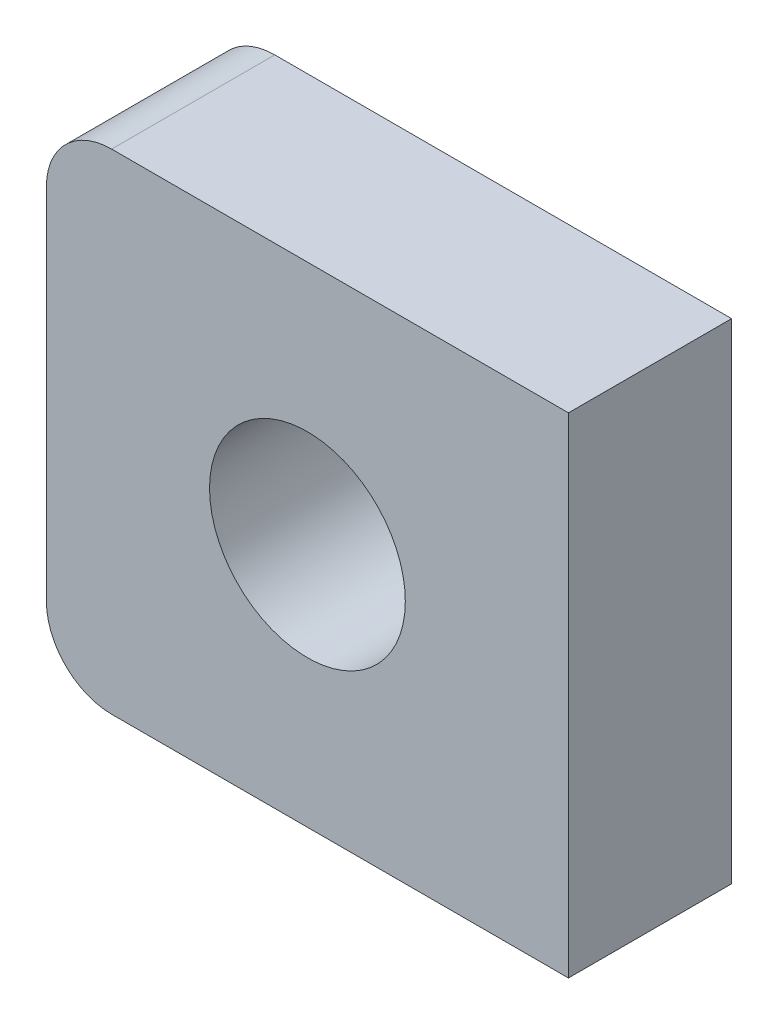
ISO-10303-21;
HEADER;
FILE_DESCRIPTION(('STEP AP214'),'2;1');
FILE_NAME('part.step','',(''),(''),'','','');
FILE_SCHEMA(('AUTOMOTIVE_DESIGN { 1 0 10303 214 1 1 1 1 }'));
ENDSEC;
DATA;
#1=APPLICATION_CONTEXT('core data for automotive mechanical design processes');
#2=APPLICATION_PROTOCOL_DEFINITION('international standard','automotive_design',2000,#1);
#3=PRODUCT_CONTEXT('',#1,'mechanical');
#4=PRODUCT('Part','Part','',(#3));
#5=PRODUCT_RELATED_PRODUCT_CATEGORY('part','',(#4));
#6=PRODUCT_DEFINITION_FORMATION('','',#4);
#7=PRODUCT_DEFINITION_CONTEXT('part definition',#1,'design');
#8=PRODUCT_DEFINITION('design','',#6,#7);
#9=PRODUCT_DEFINITION_SHAPE('','',#8);
#10=(LENGTH_UNIT() NAMED_UNIT(*) SI_UNIT(.MILLI.,.METRE.));
#11=(NAMED_UNIT(*) PLANE_ANGLE_UNIT() SI_UNIT($,.RADIAN.));
#12=(NAMED_UNIT(*) SI_UNIT($,.STERADIAN.) SOLID_ANGLE_UNIT());
#13=UNCERTAINTY_MEASURE_WITH_UNIT(LENGTH_MEASURE(1.E-05),#10,'distance_accuracy_value','');
#14=(GEOMETRIC_REPRESENTATION_CONTEXT(3) GLOBAL_UNCERTAINTY_ASSIGNED_CONTEXT((#13)) GLOBAL_UNIT_ASSIGNED_CONTEXT((#10,
#11,#12)) REPRESENTATION_CONTEXT('',''));
#15=CARTESIAN_POINT('',(0.,0.,0.));
#16=DIRECTION('',(0.,0.,1.));
#17=DIRECTION('',(1.,0.,0.));
#18=AXIS2_PLACEMENT_3D('',#15,#16,#17);
#19=CARTESIAN_POINT('',(0.,0.,5.));
#20=DIRECTION('',(0.,0.,1.));
#21=DIRECTION('',(1.,0.,0.));
#22=AXIS2_PLACEMENT_3D('',#19,#20,#21);
#23=PLANE('',#22);
#24=DIRECTION('',(0.,-1.,0.));
#25=VECTOR('',#24,1.);
#26=CARTESIAN_POINT('',(3.,0.,5.));
#27=LINE('',#26,#25);
#28=CARTESIAN_POINT('',(3.,7.50000000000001,5.));
#29=VERTEX_POINT('',#28);
#30=CARTESIAN_POINT('',(3.,-7.49999999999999,5.));
#31=VERTEX_POINT('',#30);
#32=EDGE_CURVE('E49',#29,#31,#27,.T.);
#33=ORIENTED_EDGE('',*,*,#32,.F.);
#34=DIRECTION('',(-1.,0.,0.));
#35=VECTOR('',#34,1.);
#36=CARTESIAN_POINT('',(-13.,7.50000000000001,5.));
#37=LINE('',#36,#35);
#38=CARTESIAN_POINT('',(-11.,7.50000000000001,5.));
#39=VERTEX_POINT('',#38);
#40=EDGE_CURVE('E56',#29,#39,#37,.T.);
#41=ORIENTED_EDGE('',*,*,#40,.T.);
#42=CARTESIAN_POINT('',(-11.,5.50000000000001,5.));
#43=DIRECTION('',(0.,0.,1.));
#44=DIRECTION('',(1.,0.,0.));
#45=AXIS2_PLACEMENT_3D('',#42,#43,#44);
#46=CIRCLE('',#45,2.);
#47=CARTESIAN_POINT('',(-13.,5.50000000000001,5.));
#48=VERTEX_POINT('',#47);
#49=EDGE_CURVE('E126',#39,#48,#46,.T.);
#50=ORIENTED_EDGE('',*,*,#49,.T.);
#51=DIRECTION('',(0.,-1.,0.));
#52=VECTOR('',#51,1.);
#53=CARTESIAN_POINT('',(-13.,7.50000000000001,5.));
#54=LINE('',#53,#52);
#55=CARTESIAN_POINT('',(-13.,-5.49999999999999,5.));
#56=VERTEX_POINT('',#55);
#57=EDGE_CURVE('E109',#48,#56,#54,.T.);
#58=ORIENTED_EDGE('',*,*,#57,.T.);
#59=CARTESIAN_POINT('',(-11.,-5.49999999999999,5.));
#60=DIRECTION('',(0.,0.,1.));
#61=DIRECTION('',(1.,0.,0.));
#62=AXIS2_PLACEMENT_3D('',#59,#60,#61);
#63=CIRCLE('',#62,2.);
#64=CARTESIAN_POINT('',(-11.,-7.49999999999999,5.));
#65=VERTEX_POINT('',#64);
#66=EDGE_CURVE('E42',#56,#65,#63,.T.);
#67=ORIENTED_EDGE('',*,*,#66,.T.);
#68=DIRECTION('',(1.,0.,0.));
#69=VECTOR('',#68,1.);
#70=CARTESIAN_POINT('',(-13.,-7.49999999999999,5.));
#71=LINE('',#70,#69);
#72=EDGE_CURVE('E117',#65,#31,#71,.T.);
#73=ORIENTED_EDGE('',*,*,#72,.T.);
#74=EDGE_LOOP('',(#33,#41,#50,#58,#67,#73));
#75=FACE_BOUND('',#74,.T.);
#76=CARTESIAN_POINT('',(-5.,0.,5.));
#77=DIRECTION('',(0.,0.,1.));
#78=DIRECTION('',(1.,0.,0.));
#79=AXIS2_PLACEMENT_3D('',#76,#77,#78);
#80=CIRCLE('',#79,3.);
#81=CARTESIAN_POINT('',(-2.,0.,5.));
#82=VERTEX_POINT('',#81);
#83=EDGE_CURVE('E144',#82,#82,#80,.T.);
#84=ORIENTED_EDGE('',*,*,#83,.F.);
#85=EDGE_LOOP('',(#84));
#86=FACE_BOUND('',#85,.T.);
#87=ADVANCED_FACE('F34',(#75,#86),#23,.T.);
#88=CARTESIAN_POINT('',(0.,0.,0.));
#89=DIRECTION('',(0.,0.,1.));
#90=DIRECTION('',(1.,0.,0.));
#91=AXIS2_PLACEMENT_3D('',#88,#89,#90);
#92=PLANE('',#91);
#93=DIRECTION('',(-1.,0.,0.));
#94=VECTOR('',#93,1.);
#95=CARTESIAN_POINT('',(-13.,7.50000000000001,0.));
#96=LINE('',#95,#94);
#97=CARTESIAN_POINT('',(3.,7.50000000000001,0.));
#98=VERTEX_POINT('',#97);
#99=CARTESIAN_POINT('',(-11.,7.50000000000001,0.));
#100=VERTEX_POINT('',#99);
#101=EDGE_CURVE('E101',#98,#100,#96,.T.);
#102=ORIENTED_EDGE('',*,*,#101,.F.);
#103=DIRECTION('',(0.,-1.,0.));
#104=VECTOR('',#103,1.);
#105=CARTESIAN_POINT('',(3.,-7.49999999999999,0.));
#106=LINE('',#105,#104);
#107=CARTESIAN_POINT('',(3.,-7.49999999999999,0.));
#108=VERTEX_POINT('',#107);
#109=EDGE_CURVE('E86',#98,#108,#106,.T.);
#110=ORIENTED_EDGE('',*,*,#109,.T.);
#111=DIRECTION('',(1.,0.,0.));
#112=VECTOR('',#111,1.);
#113=CARTESIAN_POINT('',(-13.,-7.49999999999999,0.));
#114=LINE('',#113,#112);
#115=CARTESIAN_POINT('',(-11.,-7.49999999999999,0.));
#116=VERTEX_POINT('',#115);
#117=EDGE_CURVE('E99',#116,#108,#114,.T.);
#118=ORIENTED_EDGE('',*,*,#117,.F.);
#119=CARTESIAN_POINT('',(-11.,-5.49999999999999,0.));
#120=DIRECTION('',(0.,0.,1.));
#121=DIRECTION('',(1.,0.,0.));
#122=AXIS2_PLACEMENT_3D('',#119,#120,#121);
#123=CIRCLE('',#122,2.);
#124=CARTESIAN_POINT('',(-13.,-5.49999999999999,0.));
#125=VERTEX_POINT('',#124);
#126=EDGE_CURVE('E119',#116,#125,#123,.F.);
#127=ORIENTED_EDGE('',*,*,#126,.T.);
#128=DIRECTION('',(0.,-1.,0.));
#129=VECTOR('',#128,1.);
#130=CARTESIAN_POINT('',(-13.,7.50000000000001,0.));
#131=LINE('',#130,#129);
#132=CARTESIAN_POINT('',(-13.,5.50000000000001,0.));
#133=VERTEX_POINT('',#132);
#134=EDGE_CURVE('E107',#133,#125,#131,.T.);
#135=ORIENTED_EDGE('',*,*,#134,.F.);
#136=CARTESIAN_POINT('',(-11.,5.50000000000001,0.));
#137=DIRECTION('',(0.,0.,1.));
#138=DIRECTION('',(1.,0.,0.));
#139=AXIS2_PLACEMENT_3D('',#136,#137,#138);
#140=CIRCLE('',#139,2.);
#141=EDGE_CURVE('E116',#133,#100,#140,.F.);
#142=ORIENTED_EDGE('',*,*,#141,.T.);
#143=EDGE_LOOP('',(#102,#110,#118,#127,#135,#142));
#144=FACE_BOUND('',#143,.T.);
#145=CARTESIAN_POINT('',(-5.,0.,0.));
#146=DIRECTION('',(0.,0.,1.));
#147=DIRECTION('',(1.,0.,0.));
#148=AXIS2_PLACEMENT_3D('',#145,#146,#147);
#149=CIRCLE('',#148,3.);
#150=CARTESIAN_POINT('',(-2.,0.,0.));
#151=VERTEX_POINT('',#150);
#152=EDGE_CURVE('E146',#151,#151,#149,.T.);
#153=ORIENTED_EDGE('',*,*,#152,.T.);
#154=EDGE_LOOP('',(#153));
#155=FACE_BOUND('',#154,.T.);
#156=ADVANCED_FACE('F97',(#144,#155),#92,.F.);
#157=CARTESIAN_POINT('',(-13.,7.50000000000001,5.));
#158=DIRECTION('',(0.,-1.,0.));
#159=DIRECTION('',(1.,0.,0.));
#160=AXIS2_PLACEMENT_3D('',#157,#158,#159);
#161=PLANE('',#160);
#162=ORIENTED_EDGE('',*,*,#40,.F.);
#163=DIRECTION('',(0.,0.,1.));
#164=VECTOR('',#163,1.);
#165=CARTESIAN_POINT('',(3.,7.50000000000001,0.));
#166=LINE('',#165,#164);
#167=EDGE_CURVE('E92',#98,#29,#166,.T.);
#168=ORIENTED_EDGE('',*,*,#167,.F.);
#169=ORIENTED_EDGE('',*,*,#101,.T.);
#170=DIRECTION('',(0.,0.,-1.));
#171=VECTOR('',#170,1.);
#172=CARTESIAN_POINT('',(-11.,7.50000000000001,5.));
#173=LINE('',#172,#171);
#174=EDGE_CURVE('E11',#100,#39,#173,.F.);
#175=ORIENTED_EDGE('',*,*,#174,.T.);
#176=EDGE_LOOP('',(#162,#168,#169,#175));
#177=FACE_BOUND('',#176,.T.);
#178=ADVANCED_FACE('F143',(#177),#161,.F.);
#179=CARTESIAN_POINT('',(-13.,7.50000000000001,5.));
#180=DIRECTION('',(1.,0.,0.));
#181=DIRECTION('',(0.,1.,0.));
#182=AXIS2_PLACEMENT_3D('',#179,#180,#181);
#183=PLANE('',#182);
#184=ORIENTED_EDGE('',*,*,#134,.T.);
#185=DIRECTION('',(0.,0.,-1.));
#186=VECTOR('',#185,1.);
#187=CARTESIAN_POINT('',(-13.,-5.49999999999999,5.));
#188=LINE('',#187,#186);
#189=EDGE_CURVE('E124',#125,#56,#188,.F.);
#190=ORIENTED_EDGE('',*,*,#189,.T.);
#191=ORIENTED_EDGE('',*,*,#57,.F.);
#192=DIRECTION('',(0.,0.,-1.));
#193=VECTOR('',#192,1.);
#194=CARTESIAN_POINT('',(-13.,5.50000000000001,5.));
#195=LINE('',#194,#193);
#196=EDGE_CURVE('E121',#48,#133,#195,.T.);
#197=ORIENTED_EDGE('',*,*,#196,.T.);
#198=EDGE_LOOP('',(#184,#190,#191,#197));
#199=FACE_BOUND('',#198,.T.);
#200=ADVANCED_FACE('F137',(#199),#183,.F.);
#201=CARTESIAN_POINT('',(-13.,-7.49999999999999,5.));
#202=DIRECTION('',(0.,1.,0.));
#203=DIRECTION('',(0.,0.,1.));
#204=AXIS2_PLACEMENT_3D('',#201,#202,#203);
#205=PLANE('',#204);
#206=ORIENTED_EDGE('',*,*,#117,.T.);
#207=DIRECTION('',(0.,0.,1.));
#208=VECTOR('',#207,1.);
#209=CARTESIAN_POINT('',(3.,-7.49999999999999,0.));
#210=LINE('',#209,#208);
#211=EDGE_CURVE('E83',#108,#31,#210,.T.);
#212=ORIENTED_EDGE('',*,*,#211,.T.);
#213=ORIENTED_EDGE('',*,*,#72,.F.);
#214=DIRECTION('',(0.,0.,-1.));
#215=VECTOR('',#214,1.);
#216=CARTESIAN_POINT('',(-11.,-7.49999999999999,5.));
#217=LINE('',#216,#215);
#218=EDGE_CURVE('E106',#65,#116,#217,.T.);
#219=ORIENTED_EDGE('',*,*,#218,.T.);
#220=EDGE_LOOP('',(#206,#212,#213,#219));
#221=FACE_BOUND('',#220,.T.);
#222=ADVANCED_FACE('F104',(#221),#205,.F.);
#223=CARTESIAN_POINT('',(-5.,0.,5.));
#224=DIRECTION('',(0.,0.,-1.));
#225=DIRECTION('',(-1.,0.,0.));
#226=AXIS2_PLACEMENT_3D('',#223,#224,#225);
#227=CYLINDRICAL_SURFACE('',#226,3.);
#228=ORIENTED_EDGE('',*,*,#83,.T.);
#229=EDGE_LOOP('',(#228));
#230=FACE_BOUND('',#229,.T.);
#231=ORIENTED_EDGE('',*,*,#152,.F.);
#232=EDGE_LOOP('',(#231));
#233=FACE_BOUND('',#232,.T.);
#234=ADVANCED_FACE('F155',(#230,#233),#227,.F.);
#235=CARTESIAN_POINT('',(-11.,-5.49999999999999,5.));
#236=DIRECTION('',(0.,0.,-1.));
#237=DIRECTION('',(-1.,0.,0.));
#238=AXIS2_PLACEMENT_3D('',#235,#236,#237);
#239=CYLINDRICAL_SURFACE('',#238,2.);
#240=ORIENTED_EDGE('',*,*,#66,.F.);
#241=ORIENTED_EDGE('',*,*,#189,.F.);
#242=ORIENTED_EDGE('',*,*,#126,.F.);
#243=ORIENTED_EDGE('',*,*,#218,.F.);
#244=EDGE_LOOP('',(#240,#241,#242,#243));
#245=FACE_BOUND('',#244,.T.);
#246=ADVANCED_FACE('F134',(#245),#239,.T.);
#247=CARTESIAN_POINT('',(-11.,5.50000000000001,5.));
#248=DIRECTION('',(0.,0.,-1.));
#249=DIRECTION('',(-1.,0.,0.));
#250=AXIS2_PLACEMENT_3D('',#247,#248,#249);
#251=CYLINDRICAL_SURFACE('',#250,2.);
#252=ORIENTED_EDGE('',*,*,#49,.F.);
#253=ORIENTED_EDGE('',*,*,#174,.F.);
#254=ORIENTED_EDGE('',*,*,#141,.F.);
#255=ORIENTED_EDGE('',*,*,#196,.F.);
#256=EDGE_LOOP('',(#252,#253,#254,#255));
#257=FACE_BOUND('',#256,.T.);
#258=ADVANCED_FACE('F36',(#257),#251,.T.);
#259=CARTESIAN_POINT('',(3.,-7.49999999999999,0.));
#260=DIRECTION('',(-1.,0.,0.));
#261=DIRECTION('',(0.,0.,1.));
#262=AXIS2_PLACEMENT_3D('',#259,#260,#261);
#263=PLANE('',#262);
#264=ORIENTED_EDGE('',*,*,#32,.T.);
#265=ORIENTED_EDGE('',*,*,#211,.F.);
#266=ORIENTED_EDGE('',*,*,#109,.F.);
#267=ORIENTED_EDGE('',*,*,#167,.T.);
#268=EDGE_LOOP('',(#264,#265,#266,#267));
#269=FACE_BOUND('',#268,.T.);
#270=ADVANCED_FACE('F85',(#269),#263,.F.);
#271=CLOSED_SHELL('',(#87,#156,#178,#200,#222,#234,#246,#258,#270));
#272=MANIFOLD_SOLID_BREP('B2',#271);
#273=ADVANCED_BREP_SHAPE_REPRESENTATION('',(#18,#272),#14);
#274=SHAPE_DEFINITION_REPRESENTATION(#9,#273);
ENDSEC;
END-ISO-10303-21;
